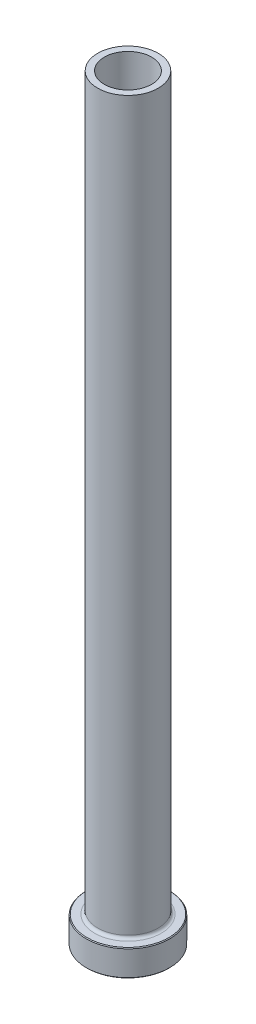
from build123d import *

# Parameters (mm, degrees)
FILLET1_R     = 0.8
CHAMFER1_SIZE = 0.2
CHAMFER3_SIZE = 0.5


with BuildPart() as part:
    # Sketch1 → Revolve1 (revolve)
    with BuildSketch(Plane.XY, mode=Mode.PRIVATE) as revolve1_sk:
        Polygon((-6.25, 200), (-8, 200), (-8, 7), (-11, 7), (-11, 0), (-6.5, 0), (-6.5, 133), (-6.25, 145), align=None)
    revolve(revolve1_sk.sketch.rotate(Axis((0, 92.187680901, 0), (0, -1, 0)), 270), axis=Axis((0, 92.187680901, 0), (0, -1, 0)))

    # Fillet1
    fillet1_edges = [part.edges().sort_by_distance(p)[0] for p in [
        (0, 7, -8),
    ]]
    fillet(fillet1_edges, radius=FILLET1_R)

    # Chamfer1
    chamfer1_edges = [part.edges().sort_by_distance(p)[0] for p in [
        (0, 0, -11),
        (0, 7, -11),
    ]]
    chamfer(chamfer1_edges, length=CHAMFER1_SIZE)

    # Chamfer3
    chamfer3_edges = [part.edges().sort_by_distance(p)[0] for p in [
        (0, 0, -6.5),
    ]]
    chamfer(chamfer3_edges, length=CHAMFER3_SIZE)


solid = part.part
